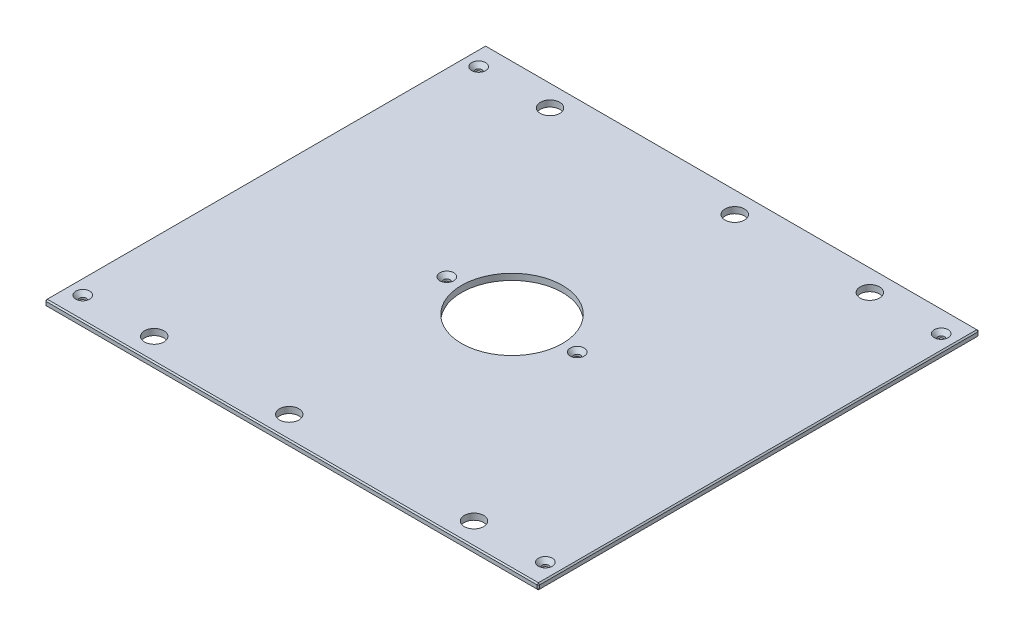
ISO-10303-21;
HEADER;
FILE_DESCRIPTION(('STEP AP214'),'2;1');
FILE_NAME('part.step','',(''),(''),'','','');
FILE_SCHEMA(('AUTOMOTIVE_DESIGN { 1 0 10303 214 1 1 1 1 }'));
ENDSEC;
DATA;
#1=APPLICATION_CONTEXT('core data for automotive mechanical design processes');
#2=APPLICATION_PROTOCOL_DEFINITION('international standard','automotive_design',2000,#1);
#3=PRODUCT_CONTEXT('',#1,'mechanical');
#4=PRODUCT('Part','Part','',(#3));
#5=PRODUCT_RELATED_PRODUCT_CATEGORY('part','',(#4));
#6=PRODUCT_DEFINITION_FORMATION('','',#4);
#7=PRODUCT_DEFINITION_CONTEXT('part definition',#1,'design');
#8=PRODUCT_DEFINITION('design','',#6,#7);
#9=PRODUCT_DEFINITION_SHAPE('','',#8);
#10=(LENGTH_UNIT() NAMED_UNIT(*) SI_UNIT(.MILLI.,.METRE.));
#11=(NAMED_UNIT(*) PLANE_ANGLE_UNIT() SI_UNIT($,.RADIAN.));
#12=(NAMED_UNIT(*) SI_UNIT($,.STERADIAN.) SOLID_ANGLE_UNIT());
#13=UNCERTAINTY_MEASURE_WITH_UNIT(LENGTH_MEASURE(1.E-05),#10,'distance_accuracy_value','');
#14=(GEOMETRIC_REPRESENTATION_CONTEXT(3) GLOBAL_UNCERTAINTY_ASSIGNED_CONTEXT((#13)) GLOBAL_UNIT_ASSIGNED_CONTEXT((#10,
#11,#12)) REPRESENTATION_CONTEXT('',''));
#15=CARTESIAN_POINT('',(0.,0.,0.));
#16=DIRECTION('',(0.,0.,1.));
#17=DIRECTION('',(1.,0.,0.));
#18=AXIS2_PLACEMENT_3D('',#15,#16,#17);
#19=CARTESIAN_POINT('',(-252.4125,6.35,-225.425));
#20=DIRECTION('',(1.,0.,0.));
#21=DIRECTION('',(0.,0.,-1.));
#22=AXIS2_PLACEMENT_3D('',#19,#20,#21);
#23=PLANE('',#22);
#24=DIRECTION('',(0.,0.,-1.));
#25=VECTOR('',#24,1.);
#26=CARTESIAN_POINT('',(-252.4125,5.08000000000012,-225.425));
#27=LINE('',#26,#25);
#28=CARTESIAN_POINT('',(-252.4125,5.08000000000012,224.155));
#29=VERTEX_POINT('',#28);
#30=CARTESIAN_POINT('',(-252.4125,5.08000000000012,-224.155));
#31=VERTEX_POINT('',#30);
#32=EDGE_CURVE('E135',#29,#31,#27,.T.);
#33=ORIENTED_EDGE('',*,*,#32,.T.);
#34=DIRECTION('',(0.,-1.,0.));
#35=VECTOR('',#34,1.);
#36=CARTESIAN_POINT('',(-252.4125,6.35,-224.155));
#37=LINE('',#36,#35);
#38=CARTESIAN_POINT('',(-252.4125,1.26999999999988,-224.155));
#39=VERTEX_POINT('',#38);
#40=EDGE_CURVE('E131',#31,#39,#37,.T.);
#41=ORIENTED_EDGE('',*,*,#40,.T.);
#42=DIRECTION('',(0.,0.,1.));
#43=VECTOR('',#42,1.);
#44=CARTESIAN_POINT('',(-252.4125,1.26999999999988,-225.425));
#45=LINE('',#44,#43);
#46=CARTESIAN_POINT('',(-252.4125,1.26999999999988,224.155));
#47=VERTEX_POINT('',#46);
#48=EDGE_CURVE('E126',#39,#47,#45,.T.);
#49=ORIENTED_EDGE('',*,*,#48,.T.);
#50=DIRECTION('',(0.,1.,0.));
#51=VECTOR('',#50,1.);
#52=CARTESIAN_POINT('',(-252.4125,6.35,224.155));
#53=LINE('',#52,#51);
#54=EDGE_CURVE('E128',#47,#29,#53,.T.);
#55=ORIENTED_EDGE('',*,*,#54,.T.);
#56=EDGE_LOOP('',(#33,#41,#49,#55));
#57=FACE_BOUND('',#56,.T.);
#58=ADVANCED_FACE('F35',(#57),#23,.F.);
#59=CARTESIAN_POINT('',(-252.4125,6.35,225.425));
#60=DIRECTION('',(0.,0.,-1.));
#61=DIRECTION('',(-1.,0.,0.));
#62=AXIS2_PLACEMENT_3D('',#59,#60,#61);
#63=PLANE('',#62);
#64=DIRECTION('',(1.,0.,0.));
#65=VECTOR('',#64,1.);
#66=CARTESIAN_POINT('',(-252.4125,1.26999999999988,225.425));
#67=LINE('',#66,#65);
#68=CARTESIAN_POINT('',(-251.1425,1.26999999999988,225.425));
#69=VERTEX_POINT('',#68);
#70=CARTESIAN_POINT('',(251.1425,1.26999999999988,225.425));
#71=VERTEX_POINT('',#70);
#72=EDGE_CURVE('E58',#69,#71,#67,.T.);
#73=ORIENTED_EDGE('',*,*,#72,.T.);
#74=DIRECTION('',(0.,1.,0.));
#75=VECTOR('',#74,1.);
#76=CARTESIAN_POINT('',(251.1425,6.35,225.425));
#77=LINE('',#76,#75);
#78=CARTESIAN_POINT('',(251.1425,5.08000000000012,225.425));
#79=VERTEX_POINT('',#78);
#80=EDGE_CURVE('E11',#71,#79,#77,.T.);
#81=ORIENTED_EDGE('',*,*,#80,.T.);
#82=DIRECTION('',(-1.,0.,0.));
#83=VECTOR('',#82,1.);
#84=CARTESIAN_POINT('',(-252.4125,5.08000000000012,225.425));
#85=LINE('',#84,#83);
#86=CARTESIAN_POINT('',(-251.1425,5.08000000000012,225.425));
#87=VERTEX_POINT('',#86);
#88=EDGE_CURVE('E44',#79,#87,#85,.T.);
#89=ORIENTED_EDGE('',*,*,#88,.T.);
#90=DIRECTION('',(0.,-1.,0.));
#91=VECTOR('',#90,1.);
#92=CARTESIAN_POINT('',(-251.1425,6.35,225.425));
#93=LINE('',#92,#91);
#94=EDGE_CURVE('E291',#87,#69,#93,.T.);
#95=ORIENTED_EDGE('',*,*,#94,.T.);
#96=EDGE_LOOP('',(#73,#81,#89,#95));
#97=FACE_BOUND('',#96,.T.);
#98=ADVANCED_FACE('F360',(#97),#63,.F.);
#99=CARTESIAN_POINT('',(252.4125,6.35,-225.425));
#100=DIRECTION('',(-1.,0.,0.));
#101=DIRECTION('',(0.,0.,1.));
#102=AXIS2_PLACEMENT_3D('',#99,#100,#101);
#103=PLANE('',#102);
#104=DIRECTION('',(0.,0.,-1.));
#105=VECTOR('',#104,1.);
#106=CARTESIAN_POINT('',(252.4125,1.26999999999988,-225.425));
#107=LINE('',#106,#105);
#108=CARTESIAN_POINT('',(252.4125,1.26999999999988,224.155));
#109=VERTEX_POINT('',#108);
#110=CARTESIAN_POINT('',(252.4125,1.26999999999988,-224.155));
#111=VERTEX_POINT('',#110);
#112=EDGE_CURVE('E286',#109,#111,#107,.T.);
#113=ORIENTED_EDGE('',*,*,#112,.T.);
#114=DIRECTION('',(0.,1.,0.));
#115=VECTOR('',#114,1.);
#116=CARTESIAN_POINT('',(252.4125,6.35,-224.155));
#117=LINE('',#116,#115);
#118=CARTESIAN_POINT('',(252.4125,5.08000000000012,-224.155));
#119=VERTEX_POINT('',#118);
#120=EDGE_CURVE('E288',#111,#119,#117,.T.);
#121=ORIENTED_EDGE('',*,*,#120,.T.);
#122=DIRECTION('',(0.,0.,1.));
#123=VECTOR('',#122,1.);
#124=CARTESIAN_POINT('',(252.4125,5.08000000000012,225.425));
#125=LINE('',#124,#123);
#126=CARTESIAN_POINT('',(252.4125,5.08000000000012,224.155));
#127=VERTEX_POINT('',#126);
#128=EDGE_CURVE('E284',#119,#127,#125,.T.);
#129=ORIENTED_EDGE('',*,*,#128,.T.);
#130=DIRECTION('',(0.,-1.,0.));
#131=VECTOR('',#130,1.);
#132=CARTESIAN_POINT('',(252.4125,6.35,224.155));
#133=LINE('',#132,#131);
#134=EDGE_CURVE('E282',#127,#109,#133,.T.);
#135=ORIENTED_EDGE('',*,*,#134,.T.);
#136=EDGE_LOOP('',(#113,#121,#129,#135));
#137=FACE_BOUND('',#136,.T.);
#138=ADVANCED_FACE('F347',(#137),#103,.F.);
#139=CARTESIAN_POINT('',(-252.4125,6.35,-225.425));
#140=DIRECTION('',(0.,0.,1.));
#141=DIRECTION('',(1.,0.,0.));
#142=AXIS2_PLACEMENT_3D('',#139,#140,#141);
#143=PLANE('',#142);
#144=DIRECTION('',(-1.,0.,0.));
#145=VECTOR('',#144,1.);
#146=CARTESIAN_POINT('',(-252.4125,1.26999999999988,-225.425));
#147=LINE('',#146,#145);
#148=CARTESIAN_POINT('',(251.1425,1.26999999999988,-225.425));
#149=VERTEX_POINT('',#148);
#150=CARTESIAN_POINT('',(-251.1425,1.26999999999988,-225.425));
#151=VERTEX_POINT('',#150);
#152=EDGE_CURVE('E258',#149,#151,#147,.T.);
#153=ORIENTED_EDGE('',*,*,#152,.T.);
#154=DIRECTION('',(0.,1.,0.));
#155=VECTOR('',#154,1.);
#156=CARTESIAN_POINT('',(-251.1425,6.35,-225.425));
#157=LINE('',#156,#155);
#158=CARTESIAN_POINT('',(-251.1425,5.08000000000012,-225.425));
#159=VERTEX_POINT('',#158);
#160=EDGE_CURVE('E262',#151,#159,#157,.T.);
#161=ORIENTED_EDGE('',*,*,#160,.T.);
#162=DIRECTION('',(1.,0.,0.));
#163=VECTOR('',#162,1.);
#164=CARTESIAN_POINT('',(252.4125,5.08000000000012,-225.425));
#165=LINE('',#164,#163);
#166=CARTESIAN_POINT('',(251.1425,5.08000000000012,-225.425));
#167=VERTEX_POINT('',#166);
#168=EDGE_CURVE('E260',#159,#167,#165,.T.);
#169=ORIENTED_EDGE('',*,*,#168,.T.);
#170=DIRECTION('',(0.,-1.,0.));
#171=VECTOR('',#170,1.);
#172=CARTESIAN_POINT('',(251.1425,6.35,-225.425));
#173=LINE('',#172,#171);
#174=EDGE_CURVE('E256',#167,#149,#173,.T.);
#175=ORIENTED_EDGE('',*,*,#174,.T.);
#176=EDGE_LOOP('',(#153,#161,#169,#175));
#177=FACE_BOUND('',#176,.T.);
#178=ADVANCED_FACE('F321',(#177),#143,.F.);
#179=CARTESIAN_POINT('',(0.,6.35,0.));
#180=DIRECTION('',(0.,1.,0.));
#181=DIRECTION('',(0.,0.,1.));
#182=AXIS2_PLACEMENT_3D('',#179,#180,#181);
#183=PLANE('',#182);
#184=CARTESIAN_POINT('',(236.5375,6.35,-202.40498));
#185=DIRECTION('',(0.,1.,0.));
#186=DIRECTION('',(0.,0.,1.));
#187=AXIS2_PLACEMENT_3D('',#184,#185,#186);
#188=CIRCLE('',#187,7.13739999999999);
#189=CARTESIAN_POINT('',(236.5375,6.35,-195.26758));
#190=VERTEX_POINT('',#189);
#191=EDGE_CURVE('E784',#190,#190,#188,.T.);
#192=ORIENTED_EDGE('',*,*,#191,.F.);
#193=EDGE_LOOP('',(#192));
#194=FACE_BOUND('',#193,.T.);
#195=CARTESIAN_POINT('',(236.5375,6.35,202.40498));
#196=DIRECTION('',(0.,1.,0.));
#197=DIRECTION('',(0.,0.,1.));
#198=AXIS2_PLACEMENT_3D('',#195,#196,#197);
#199=CIRCLE('',#198,7.13739999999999);
#200=CARTESIAN_POINT('',(236.5375,6.35,209.54238));
#201=VERTEX_POINT('',#200);
#202=EDGE_CURVE('E788',#201,#201,#199,.T.);
#203=ORIENTED_EDGE('',*,*,#202,.F.);
#204=EDGE_LOOP('',(#203));
#205=FACE_BOUND('',#204,.T.);
#206=CARTESIAN_POINT('',(-236.5375,6.35,202.40498));
#207=DIRECTION('',(0.,1.,0.));
#208=DIRECTION('',(0.,0.,1.));
#209=AXIS2_PLACEMENT_3D('',#206,#207,#208);
#210=CIRCLE('',#209,7.13739999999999);
#211=CARTESIAN_POINT('',(-236.5375,6.35,209.54238));
#212=VERTEX_POINT('',#211);
#213=EDGE_CURVE('E792',#212,#212,#210,.T.);
#214=ORIENTED_EDGE('',*,*,#213,.F.);
#215=EDGE_LOOP('',(#214));
#216=FACE_BOUND('',#215,.T.);
#217=CARTESIAN_POINT('',(-66.675,6.35,0.));
#218=DIRECTION('',(0.,1.,0.));
#219=DIRECTION('',(0.,0.,1.));
#220=AXIS2_PLACEMENT_3D('',#217,#218,#219);
#221=CIRCLE('',#220,7.1374);
#222=CARTESIAN_POINT('',(-66.675,6.35,7.1374));
#223=VERTEX_POINT('',#222);
#224=EDGE_CURVE('E796',#223,#223,#221,.T.);
#225=ORIENTED_EDGE('',*,*,#224,.F.);
#226=EDGE_LOOP('',(#225));
#227=FACE_BOUND('',#226,.T.);
#228=CARTESIAN_POINT('',(66.675,6.35,0.));
#229=DIRECTION('',(0.,1.,0.));
#230=DIRECTION('',(0.,0.,1.));
#231=AXIS2_PLACEMENT_3D('',#228,#229,#230);
#232=CIRCLE('',#231,7.1374);
#233=CARTESIAN_POINT('',(66.675,6.35,7.1374));
#234=VERTEX_POINT('',#233);
#235=EDGE_CURVE('E800',#234,#234,#232,.T.);
#236=ORIENTED_EDGE('',*,*,#235,.F.);
#237=EDGE_LOOP('',(#236));
#238=FACE_BOUND('',#237,.T.);
#239=CARTESIAN_POINT('',(-236.5375,6.35,-202.40498));
#240=DIRECTION('',(0.,1.,0.));
#241=DIRECTION('',(0.,0.,1.));
#242=AXIS2_PLACEMENT_3D('',#239,#240,#241);
#243=CIRCLE('',#242,7.13739999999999);
#244=CARTESIAN_POINT('',(-236.5375,6.35,-195.26758));
#245=VERTEX_POINT('',#244);
#246=EDGE_CURVE('E803',#245,#245,#243,.T.);
#247=ORIENTED_EDGE('',*,*,#246,.F.);
#248=EDGE_LOOP('',(#247));
#249=FACE_BOUND('',#248,.T.);
#250=DIRECTION('',(0.,0.,-1.));
#251=VECTOR('',#250,1.);
#252=CARTESIAN_POINT('',(251.1425,6.35,-225.425));
#253=LINE('',#252,#251);
#254=CARTESIAN_POINT('',(251.1425,6.35,224.155));
#255=VERTEX_POINT('',#254);
#256=CARTESIAN_POINT('',(251.1425,6.35,-224.155));
#257=VERTEX_POINT('',#256);
#258=EDGE_CURVE('E269',#255,#257,#253,.T.);
#259=ORIENTED_EDGE('',*,*,#258,.T.);
#260=DIRECTION('',(-1.,0.,0.));
#261=VECTOR('',#260,1.);
#262=CARTESIAN_POINT('',(-252.4125,6.35,-224.155));
#263=LINE('',#262,#261);
#264=CARTESIAN_POINT('',(-251.1425,6.35,-224.155));
#265=VERTEX_POINT('',#264);
#266=EDGE_CURVE('E271',#257,#265,#263,.T.);
#267=ORIENTED_EDGE('',*,*,#266,.T.);
#268=DIRECTION('',(0.,0.,1.));
#269=VECTOR('',#268,1.);
#270=CARTESIAN_POINT('',(-251.1425,6.35,225.425));
#271=LINE('',#270,#269);
#272=CARTESIAN_POINT('',(-251.1425,6.35,224.155));
#273=VERTEX_POINT('',#272);
#274=EDGE_CURVE('E267',#265,#273,#271,.T.);
#275=ORIENTED_EDGE('',*,*,#274,.T.);
#276=DIRECTION('',(1.,0.,0.));
#277=VECTOR('',#276,1.);
#278=CARTESIAN_POINT('',(252.4125,6.35,224.155));
#279=LINE('',#278,#277);
#280=EDGE_CURVE('E265',#273,#255,#279,.T.);
#281=ORIENTED_EDGE('',*,*,#280,.T.);
#282=EDGE_LOOP('',(#259,#267,#275,#281));
#283=FACE_BOUND('',#282,.T.);
#284=CARTESIAN_POINT('',(163.5125,6.35,-202.40498));
#285=DIRECTION('',(0.,1.,0.));
#286=DIRECTION('',(0.,0.,1.));
#287=AXIS2_PLACEMENT_3D('',#284,#285,#286);
#288=CIRCLE('',#287,9.921875);
#289=CARTESIAN_POINT('',(163.5125,6.35,-192.483105));
#290=VERTEX_POINT('',#289);
#291=EDGE_CURVE('E204',#290,#290,#288,.T.);
#292=ORIENTED_EDGE('',*,*,#291,.F.);
#293=EDGE_LOOP('',(#292));
#294=FACE_BOUND('',#293,.T.);
#295=CARTESIAN_POINT('',(-163.5125,6.35,-202.40498));
#296=DIRECTION('',(0.,1.,0.));
#297=DIRECTION('',(0.,0.,1.));
#298=AXIS2_PLACEMENT_3D('',#295,#296,#297);
#299=CIRCLE('',#298,9.921875);
#300=CARTESIAN_POINT('',(-163.5125,6.35,-192.483105));
#301=VERTEX_POINT('',#300);
#302=EDGE_CURVE('E214',#301,#301,#299,.T.);
#303=ORIENTED_EDGE('',*,*,#302,.F.);
#304=EDGE_LOOP('',(#303));
#305=FACE_BOUND('',#304,.T.);
#306=CARTESIAN_POINT('',(163.5125,6.35,202.40498));
#307=DIRECTION('',(0.,1.,0.));
#308=DIRECTION('',(0.,0.,1.));
#309=AXIS2_PLACEMENT_3D('',#306,#307,#308);
#310=CIRCLE('',#309,9.921875);
#311=CARTESIAN_POINT('',(163.5125,6.35,212.326855));
#312=VERTEX_POINT('',#311);
#313=EDGE_CURVE('E225',#312,#312,#310,.T.);
#314=ORIENTED_EDGE('',*,*,#313,.F.);
#315=EDGE_LOOP('',(#314));
#316=FACE_BOUND('',#315,.T.);
#317=CARTESIAN_POINT('',(-163.5125,6.35,202.40498));
#318=DIRECTION('',(0.,1.,0.));
#319=DIRECTION('',(0.,0.,1.));
#320=AXIS2_PLACEMENT_3D('',#317,#318,#319);
#321=CIRCLE('',#320,9.921875);
#322=CARTESIAN_POINT('',(-163.5125,6.35,212.326855));
#323=VERTEX_POINT('',#322);
#324=EDGE_CURVE('E231',#323,#323,#321,.T.);
#325=ORIENTED_EDGE('',*,*,#324,.F.);
#326=EDGE_LOOP('',(#325));
#327=FACE_BOUND('',#326,.T.);
#328=CARTESIAN_POINT('',(25.4,6.35,-202.40498));
#329=DIRECTION('',(0.,1.,0.));
#330=DIRECTION('',(0.,0.,1.));
#331=AXIS2_PLACEMENT_3D('',#328,#329,#330);
#332=CIRCLE('',#331,9.921875);
#333=CARTESIAN_POINT('',(25.4,6.35,-192.483105));
#334=VERTEX_POINT('',#333);
#335=EDGE_CURVE('E237',#334,#334,#332,.T.);
#336=ORIENTED_EDGE('',*,*,#335,.F.);
#337=EDGE_LOOP('',(#336));
#338=FACE_BOUND('',#337,.T.);
#339=CARTESIAN_POINT('',(-25.4,6.35,202.40498));
#340=DIRECTION('',(0.,1.,0.));
#341=DIRECTION('',(0.,0.,1.));
#342=AXIS2_PLACEMENT_3D('',#339,#340,#341);
#343=CIRCLE('',#342,9.921875);
#344=CARTESIAN_POINT('',(-25.4,6.35,212.326855));
#345=VERTEX_POINT('',#344);
#346=EDGE_CURVE('E243',#345,#345,#343,.T.);
#347=ORIENTED_EDGE('',*,*,#346,.F.);
#348=EDGE_LOOP('',(#347));
#349=FACE_BOUND('',#348,.T.);
#350=CARTESIAN_POINT('',(0.,6.35,0.));
#351=DIRECTION('',(0.,1.,0.));
#352=DIRECTION('',(0.,0.,1.));
#353=AXIS2_PLACEMENT_3D('',#350,#351,#352);
#354=CIRCLE('',#353,51.562);
#355=CARTESIAN_POINT('',(0.,6.35,51.562));
#356=VERTEX_POINT('',#355);
#357=EDGE_CURVE('E249',#356,#356,#354,.T.);
#358=ORIENTED_EDGE('',*,*,#357,.F.);
#359=EDGE_LOOP('',(#358));
#360=FACE_BOUND('',#359,.T.);
#361=ADVANCED_FACE('F369',(#194,#205,#216,#227,#238,#249,#283,#294,#305,#316,#327,#338,#349,
#360),#183,.T.);
#362=CARTESIAN_POINT('',(0.,0.,0.));
#363=DIRECTION('',(0.,1.,0.));
#364=DIRECTION('',(0.,0.,1.));
#365=AXIS2_PLACEMENT_3D('',#362,#363,#364);
#366=PLANE('',#365);
#367=CARTESIAN_POINT('',(236.5375,0.,-202.40498));
#368=DIRECTION('',(0.,1.,0.));
#369=DIRECTION('',(0.,0.,1.));
#370=AXIS2_PLACEMENT_3D('',#367,#368,#369);
#371=CIRCLE('',#370,3.3782);
#372=CARTESIAN_POINT('',(236.5375,0.,-199.02678));
#373=VERTEX_POINT('',#372);
#374=EDGE_CURVE('E837',#373,#373,#371,.T.);
#375=ORIENTED_EDGE('',*,*,#374,.T.);
#376=EDGE_LOOP('',(#375));
#377=FACE_BOUND('',#376,.T.);
#378=CARTESIAN_POINT('',(236.5375,0.,202.40498));
#379=DIRECTION('',(0.,1.,0.));
#380=DIRECTION('',(0.,0.,1.));
#381=AXIS2_PLACEMENT_3D('',#378,#379,#380);
#382=CIRCLE('',#381,3.3782);
#383=CARTESIAN_POINT('',(236.5375,0.,205.78318));
#384=VERTEX_POINT('',#383);
#385=EDGE_CURVE('E830',#384,#384,#382,.T.);
#386=ORIENTED_EDGE('',*,*,#385,.T.);
#387=EDGE_LOOP('',(#386));
#388=FACE_BOUND('',#387,.T.);
#389=CARTESIAN_POINT('',(-236.5375,0.,202.40498));
#390=DIRECTION('',(0.,1.,0.));
#391=DIRECTION('',(0.,0.,1.));
#392=AXIS2_PLACEMENT_3D('',#389,#390,#391);
#393=CIRCLE('',#392,3.3782);
#394=CARTESIAN_POINT('',(-236.5375,0.,205.78318));
#395=VERTEX_POINT('',#394);
#396=EDGE_CURVE('E823',#395,#395,#393,.T.);
#397=ORIENTED_EDGE('',*,*,#396,.T.);
#398=EDGE_LOOP('',(#397));
#399=FACE_BOUND('',#398,.T.);
#400=CARTESIAN_POINT('',(-66.675,0.,0.));
#401=DIRECTION('',(0.,1.,0.));
#402=DIRECTION('',(0.,0.,1.));
#403=AXIS2_PLACEMENT_3D('',#400,#401,#402);
#404=CIRCLE('',#403,3.3782);
#405=CARTESIAN_POINT('',(-66.675,0.,3.3782));
#406=VERTEX_POINT('',#405);
#407=EDGE_CURVE('E816',#406,#406,#404,.T.);
#408=ORIENTED_EDGE('',*,*,#407,.T.);
#409=EDGE_LOOP('',(#408));
#410=FACE_BOUND('',#409,.T.);
#411=CARTESIAN_POINT('',(66.675,0.,0.));
#412=DIRECTION('',(0.,1.,0.));
#413=DIRECTION('',(0.,0.,1.));
#414=AXIS2_PLACEMENT_3D('',#411,#412,#413);
#415=CIRCLE('',#414,3.3782);
#416=CARTESIAN_POINT('',(66.675,0.,3.3782));
#417=VERTEX_POINT('',#416);
#418=EDGE_CURVE('E806',#417,#417,#415,.T.);
#419=ORIENTED_EDGE('',*,*,#418,.T.);
#420=EDGE_LOOP('',(#419));
#421=FACE_BOUND('',#420,.T.);
#422=CARTESIAN_POINT('',(-236.5375,0.,-202.40498));
#423=DIRECTION('',(0.,1.,0.));
#424=DIRECTION('',(0.,0.,1.));
#425=AXIS2_PLACEMENT_3D('',#422,#423,#424);
#426=CIRCLE('',#425,3.3782);
#427=CARTESIAN_POINT('',(-236.5375,0.,-199.02678));
#428=VERTEX_POINT('',#427);
#429=EDGE_CURVE('E217',#428,#428,#426,.T.);
#430=ORIENTED_EDGE('',*,*,#429,.T.);
#431=EDGE_LOOP('',(#430));
#432=FACE_BOUND('',#431,.T.);
#433=DIRECTION('',(0.,0.,-1.));
#434=VECTOR('',#433,1.);
#435=CARTESIAN_POINT('',(-251.1425,0.,0.));
#436=LINE('',#435,#434);
#437=CARTESIAN_POINT('',(-251.1425,0.,224.155));
#438=VERTEX_POINT('',#437);
#439=CARTESIAN_POINT('',(-251.1425,0.,-224.155));
#440=VERTEX_POINT('',#439);
#441=EDGE_CURVE('E158',#438,#440,#436,.T.);
#442=ORIENTED_EDGE('',*,*,#441,.T.);
#443=DIRECTION('',(1.,0.,0.));
#444=VECTOR('',#443,1.);
#445=CARTESIAN_POINT('',(0.,0.,-224.155));
#446=LINE('',#445,#444);
#447=CARTESIAN_POINT('',(251.1425,0.,-224.155));
#448=VERTEX_POINT('',#447);
#449=EDGE_CURVE('E279',#440,#448,#446,.T.);
#450=ORIENTED_EDGE('',*,*,#449,.T.);
#451=DIRECTION('',(0.,0.,1.));
#452=VECTOR('',#451,1.);
#453=CARTESIAN_POINT('',(251.1425,0.,0.));
#454=LINE('',#453,#452);
#455=CARTESIAN_POINT('',(251.1425,0.,224.155));
#456=VERTEX_POINT('',#455);
#457=EDGE_CURVE('E277',#448,#456,#454,.T.);
#458=ORIENTED_EDGE('',*,*,#457,.T.);
#459=DIRECTION('',(-1.,0.,0.));
#460=VECTOR('',#459,1.);
#461=CARTESIAN_POINT('',(0.,0.,224.155));
#462=LINE('',#461,#460);
#463=EDGE_CURVE('E274',#456,#438,#462,.T.);
#464=ORIENTED_EDGE('',*,*,#463,.T.);
#465=EDGE_LOOP('',(#442,#450,#458,#464));
#466=FACE_BOUND('',#465,.T.);
#467=CARTESIAN_POINT('',(163.5125,0.,-202.40498));
#468=DIRECTION('',(0.,1.,0.));
#469=DIRECTION('',(0.,0.,1.));
#470=AXIS2_PLACEMENT_3D('',#467,#468,#469);
#471=CIRCLE('',#470,9.921875);
#472=CARTESIAN_POINT('',(163.5125,0.,-192.483105));
#473=VERTEX_POINT('',#472);
#474=EDGE_CURVE('E209',#473,#473,#471,.T.);
#475=ORIENTED_EDGE('',*,*,#474,.T.);
#476=EDGE_LOOP('',(#475));
#477=FACE_BOUND('',#476,.T.);
#478=CARTESIAN_POINT('',(-163.5125,0.,-202.40498));
#479=DIRECTION('',(0.,1.,0.));
#480=DIRECTION('',(0.,0.,1.));
#481=AXIS2_PLACEMENT_3D('',#478,#479,#480);
#482=CIRCLE('',#481,9.921875);
#483=CARTESIAN_POINT('',(-163.5125,0.,-192.483105));
#484=VERTEX_POINT('',#483);
#485=EDGE_CURVE('E222',#484,#484,#482,.T.);
#486=ORIENTED_EDGE('',*,*,#485,.T.);
#487=EDGE_LOOP('',(#486));
#488=FACE_BOUND('',#487,.T.);
#489=CARTESIAN_POINT('',(163.5125,0.,202.40498));
#490=DIRECTION('',(0.,1.,0.));
#491=DIRECTION('',(0.,0.,1.));
#492=AXIS2_PLACEMENT_3D('',#489,#490,#491);
#493=CIRCLE('',#492,9.921875);
#494=CARTESIAN_POINT('',(163.5125,0.,212.326855));
#495=VERTEX_POINT('',#494);
#496=EDGE_CURVE('E228',#495,#495,#493,.T.);
#497=ORIENTED_EDGE('',*,*,#496,.T.);
#498=EDGE_LOOP('',(#497));
#499=FACE_BOUND('',#498,.T.);
#500=CARTESIAN_POINT('',(-163.5125,0.,202.40498));
#501=DIRECTION('',(0.,1.,0.));
#502=DIRECTION('',(0.,0.,1.));
#503=AXIS2_PLACEMENT_3D('',#500,#501,#502);
#504=CIRCLE('',#503,9.921875);
#505=CARTESIAN_POINT('',(-163.5125,0.,212.326855));
#506=VERTEX_POINT('',#505);
#507=EDGE_CURVE('E234',#506,#506,#504,.T.);
#508=ORIENTED_EDGE('',*,*,#507,.T.);
#509=EDGE_LOOP('',(#508));
#510=FACE_BOUND('',#509,.T.);
#511=CARTESIAN_POINT('',(25.4,0.,-202.40498));
#512=DIRECTION('',(0.,1.,0.));
#513=DIRECTION('',(0.,0.,1.));
#514=AXIS2_PLACEMENT_3D('',#511,#512,#513);
#515=CIRCLE('',#514,9.921875);
#516=CARTESIAN_POINT('',(25.4,0.,-192.483105));
#517=VERTEX_POINT('',#516);
#518=EDGE_CURVE('E240',#517,#517,#515,.T.);
#519=ORIENTED_EDGE('',*,*,#518,.T.);
#520=EDGE_LOOP('',(#519));
#521=FACE_BOUND('',#520,.T.);
#522=CARTESIAN_POINT('',(-25.4,0.,202.40498));
#523=DIRECTION('',(0.,1.,0.));
#524=DIRECTION('',(0.,0.,1.));
#525=AXIS2_PLACEMENT_3D('',#522,#523,#524);
#526=CIRCLE('',#525,9.921875);
#527=CARTESIAN_POINT('',(-25.4,0.,212.326855));
#528=VERTEX_POINT('',#527);
#529=EDGE_CURVE('E246',#528,#528,#526,.T.);
#530=ORIENTED_EDGE('',*,*,#529,.T.);
#531=EDGE_LOOP('',(#530));
#532=FACE_BOUND('',#531,.T.);
#533=CARTESIAN_POINT('',(0.,0.,0.));
#534=DIRECTION('',(0.,1.,0.));
#535=DIRECTION('',(0.,0.,1.));
#536=AXIS2_PLACEMENT_3D('',#533,#534,#535);
#537=CIRCLE('',#536,51.562);
#538=CARTESIAN_POINT('',(0.,0.,51.562));
#539=VERTEX_POINT('',#538);
#540=EDGE_CURVE('E147',#539,#539,#537,.T.);
#541=ORIENTED_EDGE('',*,*,#540,.T.);
#542=EDGE_LOOP('',(#541));
#543=FACE_BOUND('',#542,.T.);
#544=ADVANCED_FACE('F334',(#377,#388,#399,#410,#421,#432,#466,#477,#488,#499,#510,#521,#532,
#543),#366,.F.);
#545=CARTESIAN_POINT('',(0.,0.,0.));
#546=DIRECTION('',(0.,1.,0.));
#547=DIRECTION('',(0.,0.,1.));
#548=AXIS2_PLACEMENT_3D('',#545,#546,#547);
#549=CYLINDRICAL_SURFACE('',#548,51.562);
#550=ORIENTED_EDGE('',*,*,#540,.F.);
#551=EDGE_LOOP('',(#550));
#552=FACE_BOUND('',#551,.T.);
#553=ORIENTED_EDGE('',*,*,#357,.T.);
#554=EDGE_LOOP('',(#553));
#555=FACE_BOUND('',#554,.T.);
#556=ADVANCED_FACE('F721',(#552,#555),#549,.F.);
#557=CARTESIAN_POINT('',(-25.4,6.35,202.40498));
#558=DIRECTION('',(0.,1.,0.));
#559=DIRECTION('',(0.,0.,1.));
#560=AXIS2_PLACEMENT_3D('',#557,#558,#559);
#561=CYLINDRICAL_SURFACE('',#560,9.921875);
#562=ORIENTED_EDGE('',*,*,#529,.F.);
#563=EDGE_LOOP('',(#562));
#564=FACE_BOUND('',#563,.T.);
#565=ORIENTED_EDGE('',*,*,#346,.T.);
#566=EDGE_LOOP('',(#565));
#567=FACE_BOUND('',#566,.T.);
#568=ADVANCED_FACE('F712',(#564,#567),#561,.F.);
#569=CARTESIAN_POINT('',(25.4,6.35,-202.40498));
#570=DIRECTION('',(0.,1.,0.));
#571=DIRECTION('',(0.,0.,1.));
#572=AXIS2_PLACEMENT_3D('',#569,#570,#571);
#573=CYLINDRICAL_SURFACE('',#572,9.921875);
#574=ORIENTED_EDGE('',*,*,#518,.F.);
#575=EDGE_LOOP('',(#574));
#576=FACE_BOUND('',#575,.T.);
#577=ORIENTED_EDGE('',*,*,#335,.T.);
#578=EDGE_LOOP('',(#577));
#579=FACE_BOUND('',#578,.T.);
#580=ADVANCED_FACE('F703',(#576,#579),#573,.F.);
#581=CARTESIAN_POINT('',(-163.5125,6.35,202.40498));
#582=DIRECTION('',(0.,1.,0.));
#583=DIRECTION('',(0.,0.,1.));
#584=AXIS2_PLACEMENT_3D('',#581,#582,#583);
#585=CYLINDRICAL_SURFACE('',#584,9.921875);
#586=ORIENTED_EDGE('',*,*,#507,.F.);
#587=EDGE_LOOP('',(#586));
#588=FACE_BOUND('',#587,.T.);
#589=ORIENTED_EDGE('',*,*,#324,.T.);
#590=EDGE_LOOP('',(#589));
#591=FACE_BOUND('',#590,.T.);
#592=ADVANCED_FACE('F694',(#588,#591),#585,.F.);
#593=CARTESIAN_POINT('',(163.5125,6.35,202.40498));
#594=DIRECTION('',(0.,1.,0.));
#595=DIRECTION('',(0.,0.,1.));
#596=AXIS2_PLACEMENT_3D('',#593,#594,#595);
#597=CYLINDRICAL_SURFACE('',#596,9.921875);
#598=ORIENTED_EDGE('',*,*,#496,.F.);
#599=EDGE_LOOP('',(#598));
#600=FACE_BOUND('',#599,.T.);
#601=ORIENTED_EDGE('',*,*,#313,.T.);
#602=EDGE_LOOP('',(#601));
#603=FACE_BOUND('',#602,.T.);
#604=ADVANCED_FACE('F685',(#600,#603),#597,.F.);
#605=CARTESIAN_POINT('',(-163.5125,6.35,-202.40498));
#606=DIRECTION('',(0.,1.,0.));
#607=DIRECTION('',(0.,0.,1.));
#608=AXIS2_PLACEMENT_3D('',#605,#606,#607);
#609=CYLINDRICAL_SURFACE('',#608,9.921875);
#610=ORIENTED_EDGE('',*,*,#485,.F.);
#611=EDGE_LOOP('',(#610));
#612=FACE_BOUND('',#611,.T.);
#613=ORIENTED_EDGE('',*,*,#302,.T.);
#614=EDGE_LOOP('',(#613));
#615=FACE_BOUND('',#614,.T.);
#616=ADVANCED_FACE('F675',(#612,#615),#609,.F.);
#617=CARTESIAN_POINT('',(163.5125,6.35,-202.40498));
#618=DIRECTION('',(0.,1.,0.));
#619=DIRECTION('',(0.,0.,1.));
#620=AXIS2_PLACEMENT_3D('',#617,#618,#619);
#621=CYLINDRICAL_SURFACE('',#620,9.921875);
#622=ORIENTED_EDGE('',*,*,#474,.F.);
#623=EDGE_LOOP('',(#622));
#624=FACE_BOUND('',#623,.T.);
#625=ORIENTED_EDGE('',*,*,#291,.T.);
#626=EDGE_LOOP('',(#625));
#627=FACE_BOUND('',#626,.T.);
#628=ADVANCED_FACE('F378',(#624,#627),#621,.F.);
#629=CARTESIAN_POINT('',(252.4125,6.35,224.155));
#630=DIRECTION('',(-0.707106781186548,0.,-0.707106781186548));
#631=DIRECTION('',(0.,-1.,0.));
#632=AXIS2_PLACEMENT_3D('',#629,#630,#631);
#633=PLANE('',#632);
#634=DIRECTION('',(-0.707106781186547,0.,0.707106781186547));
#635=VECTOR('',#634,1.);
#636=CARTESIAN_POINT('',(252.4125,5.08000000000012,224.155));
#637=LINE('',#636,#635);
#638=EDGE_CURVE('E39',#79,#127,#637,.F.);
#639=ORIENTED_EDGE('',*,*,#638,.F.);
#640=ORIENTED_EDGE('',*,*,#80,.F.);
#641=DIRECTION('',(0.707106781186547,0.,-0.707106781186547));
#642=VECTOR('',#641,1.);
#643=CARTESIAN_POINT('',(251.7775,1.26999999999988,224.79));
#644=LINE('',#643,#642);
#645=EDGE_CURVE('E197',#109,#71,#644,.F.);
#646=ORIENTED_EDGE('',*,*,#645,.F.);
#647=ORIENTED_EDGE('',*,*,#134,.F.);
#648=EDGE_LOOP('',(#639,#640,#646,#647));
#649=FACE_BOUND('',#648,.T.);
#650=ADVANCED_FACE('F37',(#649),#633,.F.);
#651=CARTESIAN_POINT('',(252.4125,5.08000000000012,224.155));
#652=DIRECTION('',(0.577350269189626,0.577350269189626,0.577350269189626));
#653=DIRECTION('',(0.707106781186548,0.,-0.707106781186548));
#654=AXIS2_PLACEMENT_3D('',#651,#652,#653);
#655=PLANE('',#654);
#656=DIRECTION('',(0.,-0.707106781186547,0.707106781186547));
#657=VECTOR('',#656,1.);
#658=CARTESIAN_POINT('',(251.1425,5.71500000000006,224.79));
#659=LINE('',#658,#657);
#660=EDGE_CURVE('E193',#79,#255,#659,.F.);
#661=ORIENTED_EDGE('',*,*,#660,.F.);
#662=ORIENTED_EDGE('',*,*,#638,.T.);
#663=DIRECTION('',(-0.707106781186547,0.707106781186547,0.));
#664=VECTOR('',#663,1.);
#665=CARTESIAN_POINT('',(252.4125,5.08000000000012,224.155));
#666=LINE('',#665,#664);
#667=EDGE_CURVE('E195',#255,#127,#666,.F.);
#668=ORIENTED_EDGE('',*,*,#667,.F.);
#669=EDGE_LOOP('',(#661,#662,#668));
#670=FACE_BOUND('',#669,.T.);
#671=ADVANCED_FACE('F371',(#670),#655,.T.);
#672=CARTESIAN_POINT('',(251.1425,0.,224.155));
#673=DIRECTION('',(0.577350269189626,-0.577350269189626,0.577350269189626));
#674=DIRECTION('',(0.707106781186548,0.,-0.707106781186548));
#675=AXIS2_PLACEMENT_3D('',#672,#673,#674);
#676=PLANE('',#675);
#677=DIRECTION('',(-0.707106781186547,-0.707106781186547,0.));
#678=VECTOR('',#677,1.);
#679=CARTESIAN_POINT('',(251.1425,0.,224.155));
#680=LINE('',#679,#678);
#681=EDGE_CURVE('E187',#109,#456,#680,.T.);
#682=ORIENTED_EDGE('',*,*,#681,.F.);
#683=ORIENTED_EDGE('',*,*,#645,.T.);
#684=DIRECTION('',(0.,0.707106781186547,0.707106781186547));
#685=VECTOR('',#684,1.);
#686=CARTESIAN_POINT('',(251.1425,0.,224.155));
#687=LINE('',#686,#685);
#688=EDGE_CURVE('E190',#456,#71,#687,.T.);
#689=ORIENTED_EDGE('',*,*,#688,.F.);
#690=EDGE_LOOP('',(#682,#683,#689));
#691=FACE_BOUND('',#690,.T.);
#692=ADVANCED_FACE('F340',(#691),#676,.T.);
#693=CARTESIAN_POINT('',(251.1425,6.35,0.));
#694=DIRECTION('',(0.707106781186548,0.707106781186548,0.));
#695=DIRECTION('',(0.,0.,1.));
#696=AXIS2_PLACEMENT_3D('',#693,#694,#695);
#697=PLANE('',#696);
#698=ORIENTED_EDGE('',*,*,#667,.T.);
#699=ORIENTED_EDGE('',*,*,#128,.F.);
#700=DIRECTION('',(0.707106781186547,-0.707106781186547,0.));
#701=VECTOR('',#700,1.);
#702=CARTESIAN_POINT('',(251.7775,5.71500000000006,-224.155));
#703=LINE('',#702,#701);
#704=EDGE_CURVE('E182',#257,#119,#703,.T.);
#705=ORIENTED_EDGE('',*,*,#704,.F.);
#706=ORIENTED_EDGE('',*,*,#258,.F.);
#707=EDGE_LOOP('',(#698,#699,#705,#706));
#708=FACE_BOUND('',#707,.T.);
#709=ADVANCED_FACE('F357',(#708),#697,.T.);
#710=CARTESIAN_POINT('',(0.,6.35,224.155));
#711=DIRECTION('',(0.,0.707106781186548,0.707106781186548));
#712=DIRECTION('',(-1.,0.,0.));
#713=AXIS2_PLACEMENT_3D('',#710,#711,#712);
#714=PLANE('',#713);
#715=ORIENTED_EDGE('',*,*,#660,.T.);
#716=ORIENTED_EDGE('',*,*,#280,.F.);
#717=DIRECTION('',(0.,0.707106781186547,-0.707106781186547));
#718=VECTOR('',#717,1.);
#719=CARTESIAN_POINT('',(-251.1425,6.35,224.155));
#720=LINE('',#719,#718);
#721=EDGE_CURVE('E179',#87,#273,#720,.T.);
#722=ORIENTED_EDGE('',*,*,#721,.F.);
#723=ORIENTED_EDGE('',*,*,#88,.F.);
#724=EDGE_LOOP('',(#715,#716,#722,#723));
#725=FACE_BOUND('',#724,.T.);
#726=ADVANCED_FACE('F362',(#725),#714,.T.);
#727=CARTESIAN_POINT('',(-251.1425,6.35,225.425));
#728=DIRECTION('',(0.707106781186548,0.,-0.707106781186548));
#729=DIRECTION('',(0.,-1.,0.));
#730=AXIS2_PLACEMENT_3D('',#727,#728,#729);
#731=PLANE('',#730);
#732=DIRECTION('',(0.707106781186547,0.,0.707106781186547));
#733=VECTOR('',#732,1.);
#734=CARTESIAN_POINT('',(-252.4125,1.26999999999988,224.155));
#735=LINE('',#734,#733);
#736=EDGE_CURVE('E142',#69,#47,#735,.F.);
#737=ORIENTED_EDGE('',*,*,#736,.F.);
#738=ORIENTED_EDGE('',*,*,#94,.F.);
#739=DIRECTION('',(-0.707106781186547,0.,-0.707106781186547));
#740=VECTOR('',#739,1.);
#741=CARTESIAN_POINT('',(-251.7775,5.08000000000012,224.79));
#742=LINE('',#741,#740);
#743=EDGE_CURVE('E145',#29,#87,#742,.F.);
#744=ORIENTED_EDGE('',*,*,#743,.F.);
#745=ORIENTED_EDGE('',*,*,#54,.F.);
#746=EDGE_LOOP('',(#737,#738,#744,#745));
#747=FACE_BOUND('',#746,.T.);
#748=ADVANCED_FACE('F140',(#747),#731,.F.);
#749=CARTESIAN_POINT('',(-252.4125,1.26999999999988,225.425));
#750=DIRECTION('',(0.,0.707106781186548,-0.707106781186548));
#751=DIRECTION('',(1.,0.,0.));
#752=AXIS2_PLACEMENT_3D('',#749,#750,#751);
#753=PLANE('',#752);
#754=ORIENTED_EDGE('',*,*,#688,.T.);
#755=ORIENTED_EDGE('',*,*,#72,.F.);
#756=DIRECTION('',(0.,-0.707106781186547,-0.707106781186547));
#757=VECTOR('',#756,1.);
#758=CARTESIAN_POINT('',(-251.1425,0.634999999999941,224.79));
#759=LINE('',#758,#757);
#760=EDGE_CURVE('E155',#438,#69,#759,.F.);
#761=ORIENTED_EDGE('',*,*,#760,.F.);
#762=ORIENTED_EDGE('',*,*,#463,.F.);
#763=EDGE_LOOP('',(#754,#755,#761,#762));
#764=FACE_BOUND('',#763,.T.);
#765=ADVANCED_FACE('F339',(#764),#753,.F.);
#766=CARTESIAN_POINT('',(252.4125,1.26999999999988,-225.425));
#767=DIRECTION('',(-0.707106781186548,0.707106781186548,0.));
#768=DIRECTION('',(0.,0.,-1.));
#769=AXIS2_PLACEMENT_3D('',#766,#767,#768);
#770=PLANE('',#769);
#771=ORIENTED_EDGE('',*,*,#681,.T.);
#772=ORIENTED_EDGE('',*,*,#457,.F.);
#773=DIRECTION('',(0.707106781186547,0.707106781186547,0.));
#774=VECTOR('',#773,1.);
#775=CARTESIAN_POINT('',(251.1425,0.,-224.155));
#776=LINE('',#775,#774);
#777=EDGE_CURVE('E174',#111,#448,#776,.F.);
#778=ORIENTED_EDGE('',*,*,#777,.F.);
#779=ORIENTED_EDGE('',*,*,#112,.F.);
#780=EDGE_LOOP('',(#771,#772,#778,#779));
#781=FACE_BOUND('',#780,.T.);
#782=ADVANCED_FACE('F344',(#781),#770,.F.);
#783=CARTESIAN_POINT('',(251.1425,6.35,-225.425));
#784=DIRECTION('',(-0.707106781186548,0.,0.707106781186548));
#785=DIRECTION('',(0.,-1.,0.));
#786=AXIS2_PLACEMENT_3D('',#783,#784,#785);
#787=PLANE('',#786);
#788=DIRECTION('',(0.707106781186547,0.,0.707106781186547));
#789=VECTOR('',#788,1.);
#790=CARTESIAN_POINT('',(251.1425,5.08000000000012,-225.425));
#791=LINE('',#790,#789);
#792=EDGE_CURVE('E184',#119,#167,#791,.F.);
#793=ORIENTED_EDGE('',*,*,#792,.F.);
#794=ORIENTED_EDGE('',*,*,#120,.F.);
#795=DIRECTION('',(-0.707106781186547,0.,-0.707106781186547));
#796=VECTOR('',#795,1.);
#797=CARTESIAN_POINT('',(251.7775,1.26999999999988,-224.79));
#798=LINE('',#797,#796);
#799=EDGE_CURVE('E171',#149,#111,#798,.F.);
#800=ORIENTED_EDGE('',*,*,#799,.F.);
#801=ORIENTED_EDGE('',*,*,#174,.F.);
#802=EDGE_LOOP('',(#793,#794,#800,#801));
#803=FACE_BOUND('',#802,.T.);
#804=ADVANCED_FACE('F352',(#803),#787,.F.);
#805=CARTESIAN_POINT('',(251.1425,5.08000000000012,-225.425));
#806=DIRECTION('',(0.577350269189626,0.577350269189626,-0.577350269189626));
#807=DIRECTION('',(-0.707106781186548,0.,-0.707106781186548));
#808=AXIS2_PLACEMENT_3D('',#805,#806,#807);
#809=PLANE('',#808);
#810=ORIENTED_EDGE('',*,*,#704,.T.);
#811=ORIENTED_EDGE('',*,*,#792,.T.);
#812=DIRECTION('',(0.,0.707106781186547,0.707106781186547));
#813=VECTOR('',#812,1.);
#814=CARTESIAN_POINT('',(251.1425,5.08000000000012,-225.425));
#815=LINE('',#814,#813);
#816=EDGE_CURVE('E163',#257,#167,#815,.F.);
#817=ORIENTED_EDGE('',*,*,#816,.F.);
#818=EDGE_LOOP('',(#810,#811,#817));
#819=FACE_BOUND('',#818,.T.);
#820=ADVANCED_FACE('F410',(#819),#809,.T.);
#821=CARTESIAN_POINT('',(-251.1425,6.35,224.155));
#822=DIRECTION('',(-0.577350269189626,0.577350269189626,0.577350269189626));
#823=DIRECTION('',(0.707106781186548,0.,0.707106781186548));
#824=AXIS2_PLACEMENT_3D('',#821,#822,#823);
#825=PLANE('',#824);
#826=ORIENTED_EDGE('',*,*,#743,.T.);
#827=ORIENTED_EDGE('',*,*,#721,.T.);
#828=DIRECTION('',(-0.707106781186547,-0.707106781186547,0.));
#829=VECTOR('',#828,1.);
#830=CARTESIAN_POINT('',(-251.1425,6.35,224.155));
#831=LINE('',#830,#829);
#832=EDGE_CURVE('E159',#29,#273,#831,.F.);
#833=ORIENTED_EDGE('',*,*,#832,.F.);
#834=EDGE_LOOP('',(#826,#827,#833));
#835=FACE_BOUND('',#834,.T.);
#836=ADVANCED_FACE('F364',(#835),#825,.T.);
#837=CARTESIAN_POINT('',(-252.4125,1.26999999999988,224.155));
#838=DIRECTION('',(-0.577350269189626,-0.577350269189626,0.577350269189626));
#839=DIRECTION('',(0.707106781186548,0.,0.707106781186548));
#840=AXIS2_PLACEMENT_3D('',#837,#838,#839);
#841=PLANE('',#840);
#842=ORIENTED_EDGE('',*,*,#760,.T.);
#843=ORIENTED_EDGE('',*,*,#736,.T.);
#844=DIRECTION('',(-0.707106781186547,0.707106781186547,0.));
#845=VECTOR('',#844,1.);
#846=CARTESIAN_POINT('',(-252.4125,1.26999999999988,224.155));
#847=LINE('',#846,#845);
#848=EDGE_CURVE('E152',#438,#47,#847,.T.);
#849=ORIENTED_EDGE('',*,*,#848,.F.);
#850=EDGE_LOOP('',(#842,#843,#849));
#851=FACE_BOUND('',#850,.T.);
#852=ADVANCED_FACE('F151',(#851),#841,.T.);
#853=CARTESIAN_POINT('',(251.1425,0.,-224.155));
#854=DIRECTION('',(0.577350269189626,-0.577350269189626,-0.577350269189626));
#855=DIRECTION('',(-0.707106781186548,0.,-0.707106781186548));
#856=AXIS2_PLACEMENT_3D('',#853,#854,#855);
#857=PLANE('',#856);
#858=ORIENTED_EDGE('',*,*,#799,.T.);
#859=ORIENTED_EDGE('',*,*,#777,.T.);
#860=DIRECTION('',(0.,-0.707106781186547,0.707106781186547));
#861=VECTOR('',#860,1.);
#862=CARTESIAN_POINT('',(251.1425,0.,-224.155));
#863=LINE('',#862,#861);
#864=EDGE_CURVE('E160',#149,#448,#863,.T.);
#865=ORIENTED_EDGE('',*,*,#864,.F.);
#866=EDGE_LOOP('',(#858,#859,#865));
#867=FACE_BOUND('',#866,.T.);
#868=ADVANCED_FACE('F402',(#867),#857,.T.);
#869=CARTESIAN_POINT('',(0.,6.35,-224.155));
#870=DIRECTION('',(0.,0.707106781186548,-0.707106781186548));
#871=DIRECTION('',(1.,0.,0.));
#872=AXIS2_PLACEMENT_3D('',#869,#870,#871);
#873=PLANE('',#872);
#874=ORIENTED_EDGE('',*,*,#816,.T.);
#875=ORIENTED_EDGE('',*,*,#168,.F.);
#876=DIRECTION('',(0.,-0.707106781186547,-0.707106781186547));
#877=VECTOR('',#876,1.);
#878=CARTESIAN_POINT('',(-251.1425,5.08000000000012,-225.425));
#879=LINE('',#878,#877);
#880=EDGE_CURVE('E165',#265,#159,#879,.T.);
#881=ORIENTED_EDGE('',*,*,#880,.F.);
#882=ORIENTED_EDGE('',*,*,#266,.F.);
#883=EDGE_LOOP('',(#874,#875,#881,#882));
#884=FACE_BOUND('',#883,.T.);
#885=ADVANCED_FACE('F316',(#884),#873,.T.);
#886=CARTESIAN_POINT('',(-251.1425,6.35,0.));
#887=DIRECTION('',(-0.707106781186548,0.707106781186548,0.));
#888=DIRECTION('',(0.,0.,-1.));
#889=AXIS2_PLACEMENT_3D('',#886,#887,#888);
#890=PLANE('',#889);
#891=ORIENTED_EDGE('',*,*,#832,.T.);
#892=ORIENTED_EDGE('',*,*,#274,.F.);
#893=DIRECTION('',(0.707106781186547,0.707106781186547,0.));
#894=VECTOR('',#893,1.);
#895=CARTESIAN_POINT('',(-251.7775,5.71500000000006,-224.155));
#896=LINE('',#895,#894);
#897=EDGE_CURVE('E305',#31,#265,#896,.T.);
#898=ORIENTED_EDGE('',*,*,#897,.F.);
#899=ORIENTED_EDGE('',*,*,#32,.F.);
#900=EDGE_LOOP('',(#891,#892,#898,#899));
#901=FACE_BOUND('',#900,.T.);
#902=ADVANCED_FACE('F367',(#901),#890,.T.);
#903=CARTESIAN_POINT('',(-252.4125,1.26999999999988,-225.425));
#904=DIRECTION('',(0.707106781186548,0.707106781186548,0.));
#905=DIRECTION('',(0.,0.,1.));
#906=AXIS2_PLACEMENT_3D('',#903,#904,#905);
#907=PLANE('',#906);
#908=ORIENTED_EDGE('',*,*,#848,.T.);
#909=ORIENTED_EDGE('',*,*,#48,.F.);
#910=DIRECTION('',(0.707106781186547,-0.707106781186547,0.));
#911=VECTOR('',#910,1.);
#912=CARTESIAN_POINT('',(-252.4125,1.26999999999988,-224.155));
#913=LINE('',#912,#911);
#914=EDGE_CURVE('E302',#440,#39,#913,.F.);
#915=ORIENTED_EDGE('',*,*,#914,.F.);
#916=ORIENTED_EDGE('',*,*,#441,.F.);
#917=EDGE_LOOP('',(#908,#909,#915,#916));
#918=FACE_BOUND('',#917,.T.);
#919=ADVANCED_FACE('F157',(#918),#907,.F.);
#920=CARTESIAN_POINT('',(-252.4125,1.26999999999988,-225.425));
#921=DIRECTION('',(0.,0.707106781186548,0.707106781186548));
#922=DIRECTION('',(-1.,0.,0.));
#923=AXIS2_PLACEMENT_3D('',#920,#921,#922);
#924=PLANE('',#923);
#925=ORIENTED_EDGE('',*,*,#864,.T.);
#926=ORIENTED_EDGE('',*,*,#449,.F.);
#927=DIRECTION('',(0.,0.707106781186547,-0.707106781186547));
#928=VECTOR('',#927,1.);
#929=CARTESIAN_POINT('',(-251.1425,0.634999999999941,-224.79));
#930=LINE('',#929,#928);
#931=EDGE_CURVE('E299',#151,#440,#930,.F.);
#932=ORIENTED_EDGE('',*,*,#931,.F.);
#933=ORIENTED_EDGE('',*,*,#152,.F.);
#934=EDGE_LOOP('',(#925,#926,#932,#933));
#935=FACE_BOUND('',#934,.T.);
#936=ADVANCED_FACE('F331',(#935),#924,.F.);
#937=CARTESIAN_POINT('',(-251.1425,5.08000000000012,-225.425));
#938=DIRECTION('',(-0.577350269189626,0.577350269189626,-0.577350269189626));
#939=DIRECTION('',(-0.707106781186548,0.,0.707106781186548));
#940=AXIS2_PLACEMENT_3D('',#937,#938,#939);
#941=PLANE('',#940);
#942=ORIENTED_EDGE('',*,*,#897,.T.);
#943=ORIENTED_EDGE('',*,*,#880,.T.);
#944=DIRECTION('',(0.707106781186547,0.,-0.707106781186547));
#945=VECTOR('',#944,1.);
#946=CARTESIAN_POINT('',(-251.1425,5.08000000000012,-225.425));
#947=LINE('',#946,#945);
#948=EDGE_CURVE('E297',#31,#159,#947,.T.);
#949=ORIENTED_EDGE('',*,*,#948,.F.);
#950=EDGE_LOOP('',(#942,#943,#949));
#951=FACE_BOUND('',#950,.T.);
#952=ADVANCED_FACE('F311',(#951),#941,.T.);
#953=CARTESIAN_POINT('',(-252.4125,1.26999999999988,-224.155));
#954=DIRECTION('',(-0.577350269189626,-0.577350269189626,-0.577350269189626));
#955=DIRECTION('',(-0.707106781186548,0.,0.707106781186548));
#956=AXIS2_PLACEMENT_3D('',#953,#954,#955);
#957=PLANE('',#956);
#958=ORIENTED_EDGE('',*,*,#931,.T.);
#959=ORIENTED_EDGE('',*,*,#914,.T.);
#960=DIRECTION('',(-0.707106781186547,0.,0.707106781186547));
#961=VECTOR('',#960,1.);
#962=CARTESIAN_POINT('',(-252.4125,1.26999999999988,-224.155));
#963=LINE('',#962,#961);
#964=EDGE_CURVE('E295',#151,#39,#963,.T.);
#965=ORIENTED_EDGE('',*,*,#964,.F.);
#966=EDGE_LOOP('',(#958,#959,#965));
#967=FACE_BOUND('',#966,.T.);
#968=ADVANCED_FACE('F328',(#967),#957,.T.);
#969=CARTESIAN_POINT('',(-252.4125,6.35,-224.155));
#970=DIRECTION('',(0.707106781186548,0.,0.707106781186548));
#971=DIRECTION('',(0.,-1.,0.));
#972=AXIS2_PLACEMENT_3D('',#969,#970,#971);
#973=PLANE('',#972);
#974=ORIENTED_EDGE('',*,*,#948,.T.);
#975=ORIENTED_EDGE('',*,*,#160,.F.);
#976=ORIENTED_EDGE('',*,*,#964,.T.);
#977=ORIENTED_EDGE('',*,*,#40,.F.);
#978=EDGE_LOOP('',(#974,#975,#976,#977));
#979=FACE_BOUND('',#978,.T.);
#980=ADVANCED_FACE('F326',(#979),#973,.F.);
#981=CARTESIAN_POINT('',(-236.5375,6.35,-202.40498));
#982=DIRECTION('',(0.,1.,0.));
#983=DIRECTION('',(0.,0.,1.));
#984=AXIS2_PLACEMENT_3D('',#981,#982,#983);
#985=CYLINDRICAL_SURFACE('',#984,3.3782);
#986=ORIENTED_EDGE('',*,*,#429,.F.);
#987=EDGE_LOOP('',(#986));
#988=FACE_BOUND('',#987,.T.);
#989=CARTESIAN_POINT('',(-236.5375,2.02553508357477,-202.40498));
#990=DIRECTION('',(0.,1.,0.));
#991=DIRECTION('',(0.,0.,1.));
#992=AXIS2_PLACEMENT_3D('',#989,#990,#991);
#993=CIRCLE('',#992,3.3782);
#994=CARTESIAN_POINT('',(-236.5375,2.02553508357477,-199.02678));
#995=VERTEX_POINT('',#994);
#996=EDGE_CURVE('E805',#995,#995,#993,.T.);
#997=ORIENTED_EDGE('',*,*,#996,.T.);
#998=EDGE_LOOP('',(#997));
#999=FACE_BOUND('',#998,.T.);
#1000=ADVANCED_FACE('F389',(#988,#999),#985,.F.);
#1001=CARTESIAN_POINT('',(-236.5375,6.35,-202.40498));
#1002=DIRECTION('',(0.,1.,0.));
#1003=DIRECTION('',(0.,0.,1.));
#1004=AXIS2_PLACEMENT_3D('',#1001,#1002,#1003);
#1005=CONICAL_SURFACE('',#1004,7.13739999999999,0.715584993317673);
#1006=ORIENTED_EDGE('',*,*,#996,.F.);
#1007=EDGE_LOOP('',(#1006));
#1008=FACE_BOUND('',#1007,.T.);
#1009=ORIENTED_EDGE('',*,*,#246,.T.);
#1010=EDGE_LOOP('',(#1009));
#1011=FACE_BOUND('',#1010,.T.);
#1012=ADVANCED_FACE('F499',(#1008,#1011),#1005,.F.);
#1013=CARTESIAN_POINT('',(66.675,6.35,0.));
#1014=DIRECTION('',(0.,1.,0.));
#1015=DIRECTION('',(0.,0.,1.));
#1016=AXIS2_PLACEMENT_3D('',#1013,#1014,#1015);
#1017=CYLINDRICAL_SURFACE('',#1016,3.3782);
#1018=ORIENTED_EDGE('',*,*,#418,.F.);
#1019=EDGE_LOOP('',(#1018));
#1020=FACE_BOUND('',#1019,.T.);
#1021=CARTESIAN_POINT('',(66.675,2.02553508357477,0.));
#1022=DIRECTION('',(0.,1.,0.));
#1023=DIRECTION('',(0.,0.,1.));
#1024=AXIS2_PLACEMENT_3D('',#1021,#1022,#1023);
#1025=CIRCLE('',#1024,3.3782);
#1026=CARTESIAN_POINT('',(66.675,2.02553508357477,3.3782));
#1027=VERTEX_POINT('',#1026);
#1028=EDGE_CURVE('E810',#1027,#1027,#1025,.T.);
#1029=ORIENTED_EDGE('',*,*,#1028,.T.);
#1030=EDGE_LOOP('',(#1029));
#1031=FACE_BOUND('',#1030,.T.);
#1032=ADVANCED_FACE('F508',(#1020,#1031),#1017,.F.);
#1033=CARTESIAN_POINT('',(66.675,6.35,0.));
#1034=DIRECTION('',(0.,1.,0.));
#1035=DIRECTION('',(0.,0.,1.));
#1036=AXIS2_PLACEMENT_3D('',#1033,#1034,#1035);
#1037=CONICAL_SURFACE('',#1036,7.1374,0.715584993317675);
#1038=ORIENTED_EDGE('',*,*,#1028,.F.);
#1039=EDGE_LOOP('',(#1038));
#1040=FACE_BOUND('',#1039,.T.);
#1041=ORIENTED_EDGE('',*,*,#235,.T.);
#1042=EDGE_LOOP('',(#1041));
#1043=FACE_BOUND('',#1042,.T.);
#1044=ADVANCED_FACE('F516',(#1040,#1043),#1037,.F.);
#1045=CARTESIAN_POINT('',(-66.675,6.35,0.));
#1046=DIRECTION('',(0.,1.,0.));
#1047=DIRECTION('',(0.,0.,1.));
#1048=AXIS2_PLACEMENT_3D('',#1045,#1046,#1047);
#1049=CYLINDRICAL_SURFACE('',#1048,3.3782);
#1050=ORIENTED_EDGE('',*,*,#407,.F.);
#1051=EDGE_LOOP('',(#1050));
#1052=FACE_BOUND('',#1051,.T.);
#1053=CARTESIAN_POINT('',(-66.675,2.02553508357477,0.));
#1054=DIRECTION('',(0.,1.,0.));
#1055=DIRECTION('',(0.,0.,1.));
#1056=AXIS2_PLACEMENT_3D('',#1053,#1054,#1055);
#1057=CIRCLE('',#1056,3.3782);
#1058=CARTESIAN_POINT('',(-66.675,2.02553508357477,3.3782));
#1059=VERTEX_POINT('',#1058);
#1060=EDGE_CURVE('E819',#1059,#1059,#1057,.T.);
#1061=ORIENTED_EDGE('',*,*,#1060,.T.);
#1062=EDGE_LOOP('',(#1061));
#1063=FACE_BOUND('',#1062,.T.);
#1064=ADVANCED_FACE('F524',(#1052,#1063),#1049,.F.);
#1065=CARTESIAN_POINT('',(-66.675,6.35,0.));
#1066=DIRECTION('',(0.,1.,0.));
#1067=DIRECTION('',(0.,0.,1.));
#1068=AXIS2_PLACEMENT_3D('',#1065,#1066,#1067);
#1069=CONICAL_SURFACE('',#1068,7.1374,0.715584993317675);
#1070=ORIENTED_EDGE('',*,*,#1060,.F.);
#1071=EDGE_LOOP('',(#1070));
#1072=FACE_BOUND('',#1071,.T.);
#1073=ORIENTED_EDGE('',*,*,#224,.T.);
#1074=EDGE_LOOP('',(#1073));
#1075=FACE_BOUND('',#1074,.T.);
#1076=ADVANCED_FACE('F532',(#1072,#1075),#1069,.F.);
#1077=CARTESIAN_POINT('',(-236.5375,6.35,202.40498));
#1078=DIRECTION('',(0.,1.,0.));
#1079=DIRECTION('',(0.,0.,1.));
#1080=AXIS2_PLACEMENT_3D('',#1077,#1078,#1079);
#1081=CYLINDRICAL_SURFACE('',#1080,3.3782);
#1082=ORIENTED_EDGE('',*,*,#396,.F.);
#1083=EDGE_LOOP('',(#1082));
#1084=FACE_BOUND('',#1083,.T.);
#1085=CARTESIAN_POINT('',(-236.5375,2.02553508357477,202.40498));
#1086=DIRECTION('',(0.,1.,0.));
#1087=DIRECTION('',(0.,0.,1.));
#1088=AXIS2_PLACEMENT_3D('',#1085,#1086,#1087);
#1089=CIRCLE('',#1088,3.3782);
#1090=CARTESIAN_POINT('',(-236.5375,2.02553508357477,205.78318));
#1091=VERTEX_POINT('',#1090);
#1092=EDGE_CURVE('E826',#1091,#1091,#1089,.T.);
#1093=ORIENTED_EDGE('',*,*,#1092,.T.);
#1094=EDGE_LOOP('',(#1093));
#1095=FACE_BOUND('',#1094,.T.);
#1096=ADVANCED_FACE('F540',(#1084,#1095),#1081,.F.);
#1097=CARTESIAN_POINT('',(-236.5375,6.35,202.40498));
#1098=DIRECTION('',(0.,1.,0.));
#1099=DIRECTION('',(0.,0.,1.));
#1100=AXIS2_PLACEMENT_3D('',#1097,#1098,#1099);
#1101=CONICAL_SURFACE('',#1100,7.13739999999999,0.715584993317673);
#1102=ORIENTED_EDGE('',*,*,#1092,.F.);
#1103=EDGE_LOOP('',(#1102));
#1104=FACE_BOUND('',#1103,.T.);
#1105=ORIENTED_EDGE('',*,*,#213,.T.);
#1106=EDGE_LOOP('',(#1105));
#1107=FACE_BOUND('',#1106,.T.);
#1108=ADVANCED_FACE('F548',(#1104,#1107),#1101,.F.);
#1109=CARTESIAN_POINT('',(236.5375,6.35,202.40498));
#1110=DIRECTION('',(0.,1.,0.));
#1111=DIRECTION('',(0.,0.,1.));
#1112=AXIS2_PLACEMENT_3D('',#1109,#1110,#1111);
#1113=CYLINDRICAL_SURFACE('',#1112,3.3782);
#1114=ORIENTED_EDGE('',*,*,#385,.F.);
#1115=EDGE_LOOP('',(#1114));
#1116=FACE_BOUND('',#1115,.T.);
#1117=CARTESIAN_POINT('',(236.5375,2.02553508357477,202.40498));
#1118=DIRECTION('',(0.,1.,0.));
#1119=DIRECTION('',(0.,0.,1.));
#1120=AXIS2_PLACEMENT_3D('',#1117,#1118,#1119);
#1121=CIRCLE('',#1120,3.3782);
#1122=CARTESIAN_POINT('',(236.5375,2.02553508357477,205.78318));
#1123=VERTEX_POINT('',#1122);
#1124=EDGE_CURVE('E833',#1123,#1123,#1121,.T.);
#1125=ORIENTED_EDGE('',*,*,#1124,.T.);
#1126=EDGE_LOOP('',(#1125));
#1127=FACE_BOUND('',#1126,.T.);
#1128=ADVANCED_FACE('F556',(#1116,#1127),#1113,.F.);
#1129=CARTESIAN_POINT('',(236.5375,6.35,202.40498));
#1130=DIRECTION('',(0.,1.,0.));
#1131=DIRECTION('',(0.,0.,1.));
#1132=AXIS2_PLACEMENT_3D('',#1129,#1130,#1131);
#1133=CONICAL_SURFACE('',#1132,7.13739999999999,0.715584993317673);
#1134=ORIENTED_EDGE('',*,*,#1124,.F.);
#1135=EDGE_LOOP('',(#1134));
#1136=FACE_BOUND('',#1135,.T.);
#1137=ORIENTED_EDGE('',*,*,#202,.T.);
#1138=EDGE_LOOP('',(#1137));
#1139=FACE_BOUND('',#1138,.T.);
#1140=ADVANCED_FACE('F564',(#1136,#1139),#1133,.F.);
#1141=CARTESIAN_POINT('',(236.5375,6.35,-202.40498));
#1142=DIRECTION('',(0.,1.,0.));
#1143=DIRECTION('',(0.,0.,1.));
#1144=AXIS2_PLACEMENT_3D('',#1141,#1142,#1143);
#1145=CYLINDRICAL_SURFACE('',#1144,3.3782);
#1146=ORIENTED_EDGE('',*,*,#374,.F.);
#1147=EDGE_LOOP('',(#1146));
#1148=FACE_BOUND('',#1147,.T.);
#1149=CARTESIAN_POINT('',(236.5375,2.02553508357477,-202.40498));
#1150=DIRECTION('',(0.,1.,0.));
#1151=DIRECTION('',(0.,0.,1.));
#1152=AXIS2_PLACEMENT_3D('',#1149,#1150,#1151);
#1153=CIRCLE('',#1152,3.3782);
#1154=CARTESIAN_POINT('',(236.5375,2.02553508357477,-199.02678));
#1155=VERTEX_POINT('',#1154);
#1156=EDGE_CURVE('E840',#1155,#1155,#1153,.T.);
#1157=ORIENTED_EDGE('',*,*,#1156,.T.);
#1158=EDGE_LOOP('',(#1157));
#1159=FACE_BOUND('',#1158,.T.);
#1160=ADVANCED_FACE('F572',(#1148,#1159),#1145,.F.);
#1161=CARTESIAN_POINT('',(236.5375,6.35,-202.40498));
#1162=DIRECTION('',(0.,1.,0.));
#1163=DIRECTION('',(0.,0.,1.));
#1164=AXIS2_PLACEMENT_3D('',#1161,#1162,#1163);
#1165=CONICAL_SURFACE('',#1164,7.13739999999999,0.715584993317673);
#1166=ORIENTED_EDGE('',*,*,#1156,.F.);
#1167=EDGE_LOOP('',(#1166));
#1168=FACE_BOUND('',#1167,.T.);
#1169=ORIENTED_EDGE('',*,*,#191,.T.);
#1170=EDGE_LOOP('',(#1169));
#1171=FACE_BOUND('',#1170,.T.);
#1172=ADVANCED_FACE('F580',(#1168,#1171),#1165,.F.);
#1173=CLOSED_SHELL('',(#58,#98,#138,#178,#361,#544,#556,#568,#580,#592,#604,#616,#628,#650,#671,
#692,#709,#726,#748,#765,#782,#804,#820,#836,#852,#868,#885,#902,#919,#936,#952,#968,#980,#1000,
#1012,#1032,#1044,#1064,#1076,#1096,#1108,#1128,#1140,#1160,#1172));
#1174=MANIFOLD_SOLID_BREP('B2',#1173);
#1175=ADVANCED_BREP_SHAPE_REPRESENTATION('',(#18,#1174),#14);
#1176=SHAPE_DEFINITION_REPRESENTATION(#9,#1175);
ENDSEC;
END-ISO-10303-21;
